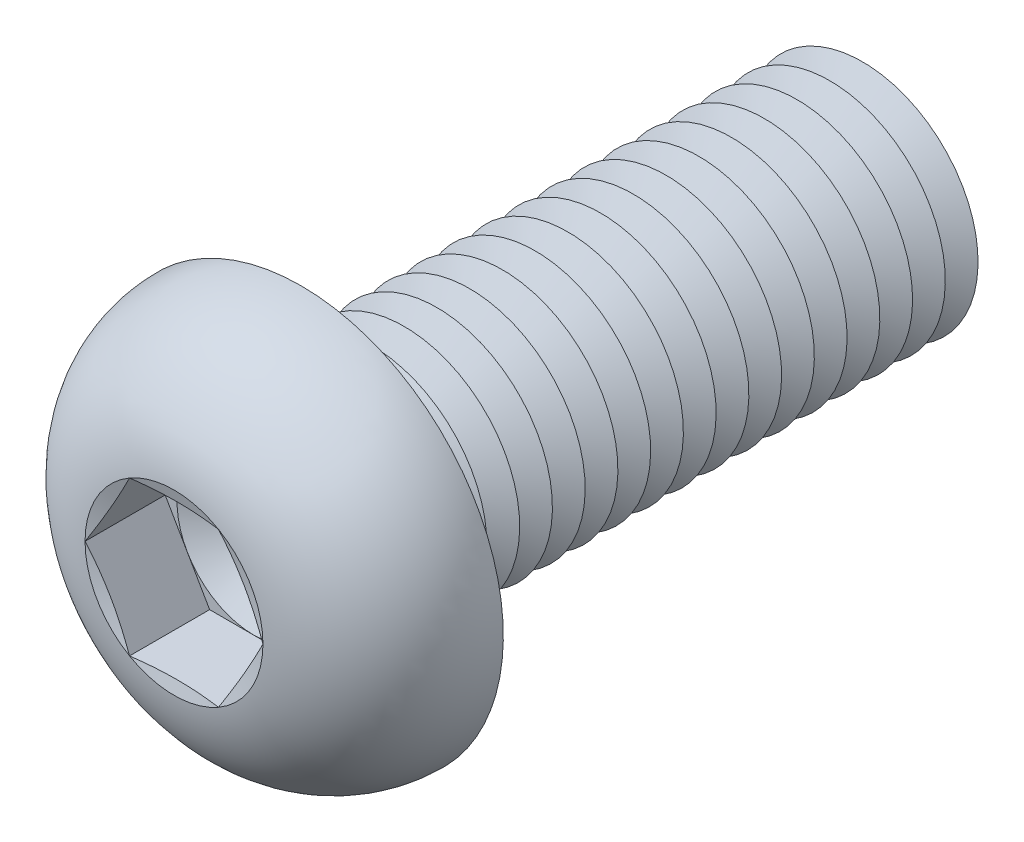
from build123d import *

# Parameters (mm, degrees)
FILLET1_R          = 0.85
LPATTERN1_COUNT    = 17
LPATTERN1_PITCH    = 1.7
CUT_EXTRUDE1_DEPTH = 4.16


with BuildPart() as part:
    # Sketch1 → Revolve1 (revolve)
    with BuildSketch(Plane(origin=(0, 0, 0), x_dir=(0, 0, -1), z_dir=(1, 0, 0))):
        with BuildLine():
            Line((0, 6), (0, 10.5))
            ThreePointArc((0, 10.5), (-4.420082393, 8.816378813), (-6.6, 4.6188))
            Line((-6.6, 4.6188), (-5.981198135, 2.3094))
            Line((-5.981198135, 2.3094), (-6.6, 2.3094))
            Line((-6.6, 2.3094), (-6.6, 0))
            Line((-6.6, 0), (30, 0))
            Line((30, 0), (30, 6))
            Line((30, 6), (0, 6))
        make_face()
    revolve(axis=Axis((0, 0, -30), (0, 0, 1)))

    # Fillet1
    fillet1_edges = [part.edges().sort_by_distance(p)[0] for p in [
        (0, -6, 0),
    ]]
    fillet(fillet1_edges, radius=FILLET1_R)

    # Sketch2 → Cut-Revolve1 (revolve, cut)
    with BuildSketch(Plane(origin=(0, 0, 0), x_dir=(0, 0, -1), z_dir=(1, 0, 0))):
        Polygon((29.15, 6), (30.85, 6), (30, 4.527756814), align=None)
    cut_revolve1 = revolve(axis=Axis((0, 0, -30), (0, 0, -1)), mode=Mode.SUBTRACT)

    # LPattern1: Cut-Revolve1 ×17
    with Locations(*[(0, 0, i * LPATTERN1_PITCH) for i in range(1, LPATTERN1_COUNT)]):
        add(cut_revolve1, mode=Mode.SUBTRACT)

    # Sketch3 → Cut-Extrude1 (cut)
    with BuildSketch(Plane.XY.offset(6.6)):
        Polygon((2.3094, 3.999998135), (-2.3094, 3.999998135), (-4.6188, 0), (-2.3094, -3.999998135), (2.3094, -3.999998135), (4.6188, 0), align=None)
    extrude(amount=-CUT_EXTRUDE1_DEPTH, mode=Mode.SUBTRACT)

    # Cut-Extrude2 cone 1 section (on through the dimple's axis) → Cut-Extrude2 (revolve, cut)
    with BuildSketch(Plane(origin=(0, 0, 2.44), x_dir=(0, -1, 0), z_dir=(1, 0, 0))):
        Polygon((0, 0), (3.999998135, 0), (0, 2.3094), align=None)
    revolve(axis=Axis((0, 0, 2.44), (0, 0, -1)), mode=Mode.SUBTRACT)


solid = part.part
